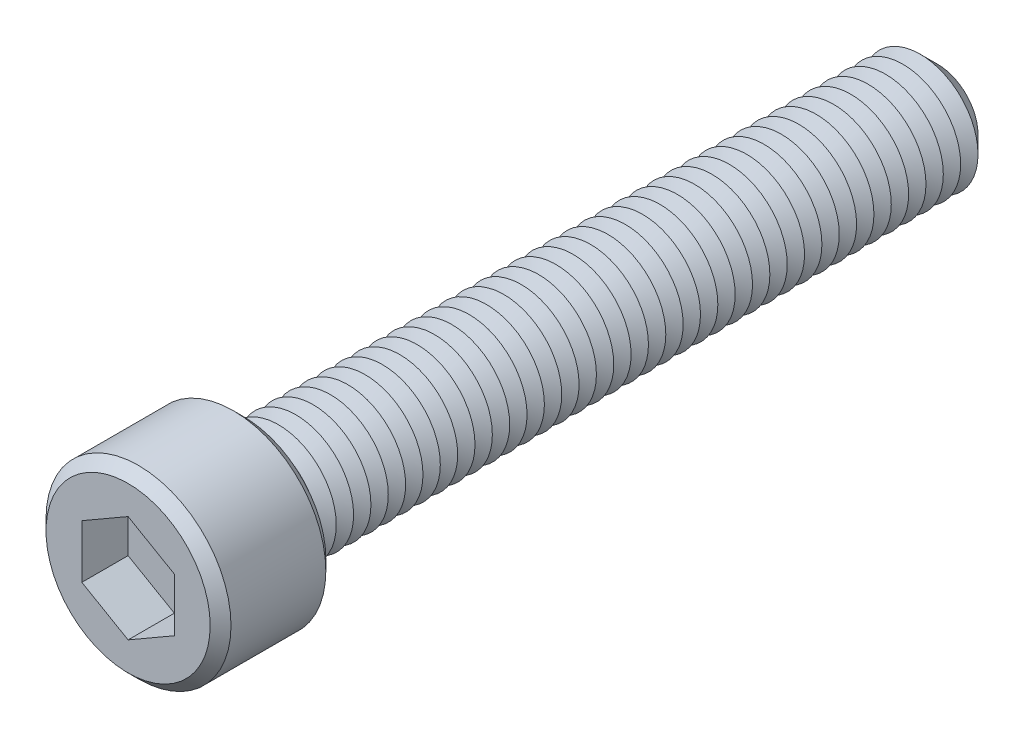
from build123d import *

# Parameters (mm, degrees)
SKETCH1_R           = 8
BOSS_EXTRUDE1_DEPTH = 10
SKETCH2_R           = 5
BOSS_EXTRUDE2_DEPTH = 60
CHAMFER1_SIZE       = 1.5
LPATTERN1_COUNT     = 39
LPATTERN1_PITCH     = 1.5
CUT_EXTRUDE1_DEPTH  = 4
SKETCH6_R           = 0.9
CUT_EXTRUDE2_DEPTH  = 66
CHAMFER2_SIZE       = 0.9


with BuildPart() as part:
    # Sketch1 → Boss-Extrude1 (new body)
    with BuildSketch(Plane.XY):
        Circle(SKETCH1_R)
    extrude(amount=BOSS_EXTRUDE1_DEPTH)

    # Sketch2 → Boss-Extrude2 (add)
    with BuildSketch(Plane(origin=(0, 0, 0), x_dir=(-1, 0, 0), z_dir=(0, 0, -1))):
        Circle(SKETCH2_R)
    extrude(amount=BOSS_EXTRUDE2_DEPTH)

    # Chamfer1
    chamfer1_edges = [part.edges().sort_by_distance(p)[0] for p in [
        (5, 0, -60),
    ]]
    chamfer(chamfer1_edges, length=CHAMFER1_SIZE)

    # Sketch4 → Cut-Revolve1 (revolve, cut)
    with BuildSketch(Plane(origin=(0, 0, 0), x_dir=(0, 0, -1), z_dir=(1, 0, 0)), mode=Mode.PRIVATE) as cut_revolve1_sk:
        Polygon((0, 5), (0.75, 3.700961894), (1.5, 5), align=None)
    cut_revolve1 = revolve(cut_revolve1_sk.sketch.rotate(Axis((0, 0, 2.512122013), (0, 0, -1)), 90), axis=Axis((0, 0, 2.512122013), (0, 0, -1)), mode=Mode.SUBTRACT)

    # LPattern1: Cut-Revolve1 ×39
    with Locations(*[(0, 0, -i * LPATTERN1_PITCH) for i in range(1, LPATTERN1_COUNT)]):
        add(cut_revolve1, mode=Mode.SUBTRACT)

    # Sketch5 → Cut-Extrude1 (cut)
    with BuildSketch(Plane.XY.offset(10)):
        Polygon((0, 4.618802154), (-4, 2.309401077), (-4, -2.309401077), (0, -4.618802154), (4, -2.309401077), (4, 2.309401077), align=None)
    extrude(amount=-CUT_EXTRUDE1_DEPTH, mode=Mode.SUBTRACT)

    # Sketch6 → Cut-Extrude2 (cut)
    with BuildSketch(Plane.XY.offset(6)):
        Circle(SKETCH6_R)
    extrude(amount=-CUT_EXTRUDE2_DEPTH, mode=Mode.SUBTRACT)

    # Chamfer2
    chamfer2_edges = [part.edges().sort_by_distance(p)[0] for p in [
        (-8, 0, 0),
        (-8, 0, 10),
    ]]
    chamfer(chamfer2_edges, length=CHAMFER2_SIZE)


solid = part.part
